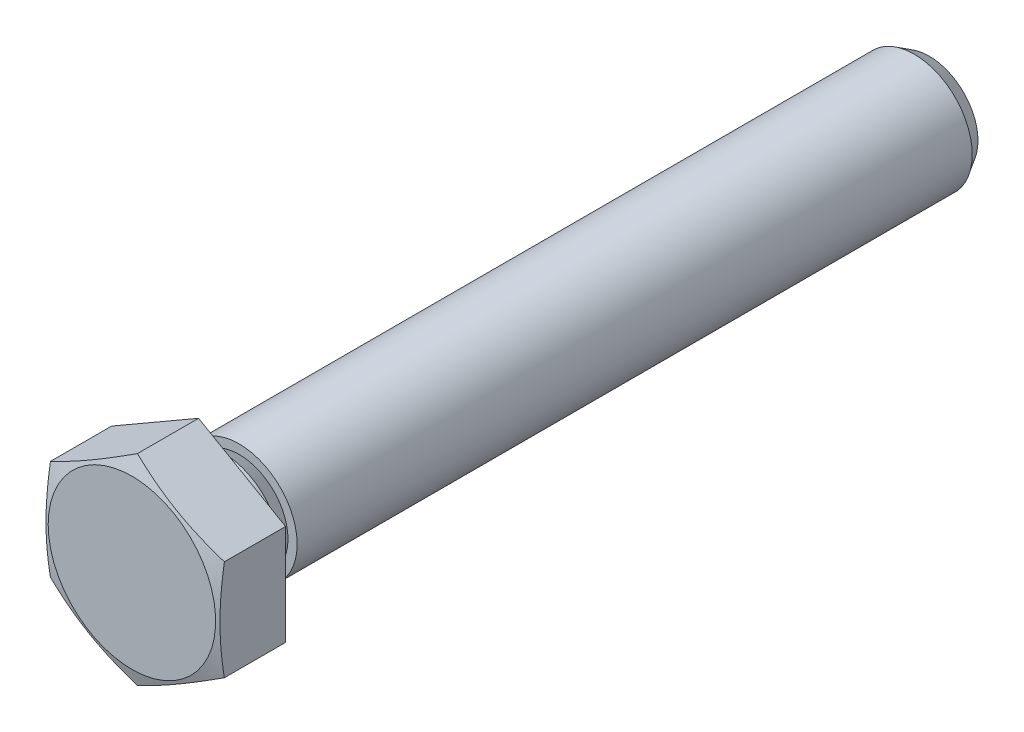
ISO-10303-21;
HEADER;
FILE_DESCRIPTION(('STEP AP214'),'2;1');
FILE_NAME('part.step','',(''),(''),'','','');
FILE_SCHEMA(('AUTOMOTIVE_DESIGN { 1 0 10303 214 1 1 1 1 }'));
ENDSEC;
DATA;
#1=APPLICATION_CONTEXT('core data for automotive mechanical design processes');
#2=APPLICATION_PROTOCOL_DEFINITION('international standard','automotive_design',2000,#1);
#3=PRODUCT_CONTEXT('',#1,'mechanical');
#4=PRODUCT('Part','Part','',(#3));
#5=PRODUCT_RELATED_PRODUCT_CATEGORY('part','',(#4));
#6=PRODUCT_DEFINITION_FORMATION('','',#4);
#7=PRODUCT_DEFINITION_CONTEXT('part definition',#1,'design');
#8=PRODUCT_DEFINITION('design','',#6,#7);
#9=PRODUCT_DEFINITION_SHAPE('','',#8);
#10=(LENGTH_UNIT() NAMED_UNIT(*) SI_UNIT(.MILLI.,.METRE.));
#11=(NAMED_UNIT(*) PLANE_ANGLE_UNIT() SI_UNIT($,.RADIAN.));
#12=(NAMED_UNIT(*) SI_UNIT($,.STERADIAN.) SOLID_ANGLE_UNIT());
#13=UNCERTAINTY_MEASURE_WITH_UNIT(LENGTH_MEASURE(1.E-05),#10,'distance_accuracy_value','');
#14=(GEOMETRIC_REPRESENTATION_CONTEXT(3) GLOBAL_UNCERTAINTY_ASSIGNED_CONTEXT((#13)) GLOBAL_UNIT_ASSIGNED_CONTEXT((#10,
#11,#12)) REPRESENTATION_CONTEXT('',''));
#15=CARTESIAN_POINT('',(0.,0.,0.));
#16=DIRECTION('',(0.,0.,1.));
#17=DIRECTION('',(1.,0.,0.));
#18=AXIS2_PLACEMENT_3D('',#15,#16,#17);
#19=CARTESIAN_POINT('',(0.,0.,0.600000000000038));
#20=DIRECTION('',(0.,0.,1.));
#21=DIRECTION('',(1.,0.,0.));
#22=AXIS2_PLACEMENT_3D('',#19,#20,#21);
#23=TOROIDAL_SURFACE('',#22,7.6,0.6);
#24=CARTESIAN_POINT('',(0.,0.,0.600000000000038));
#25=DIRECTION('',(0.,0.,1.));
#26=DIRECTION('',(1.,0.,0.));
#27=AXIS2_PLACEMENT_3D('',#24,#25,#26);
#28=CIRCLE('',#27,8.2);
#29=CARTESIAN_POINT('',(8.20000000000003,0.,0.600000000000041));
#30=VERTEX_POINT('',#29);
#31=EDGE_CURVE('E11',#30,#30,#28,.T.);
#32=ORIENTED_EDGE('',*,*,#31,.F.);
#33=EDGE_LOOP('',(#32));
#34=FACE_BOUND('',#33,.T.);
#35=CARTESIAN_POINT('',(0.,0.,0.));
#36=DIRECTION('',(0.,0.,1.));
#37=DIRECTION('',(1.,0.,0.));
#38=AXIS2_PLACEMENT_3D('',#35,#36,#37);
#39=CIRCLE('',#38,7.6);
#40=CARTESIAN_POINT('',(7.6,0.,0.));
#41=VERTEX_POINT('',#40);
#42=EDGE_CURVE('E24',#41,#41,#39,.T.);
#43=ORIENTED_EDGE('',*,*,#42,.T.);
#44=EDGE_LOOP('',(#43));
#45=FACE_BOUND('',#44,.T.);
#46=ADVANCED_FACE('F17',(#34,#45),#23,.T.);
#47=CARTESIAN_POINT('',(0.,7.6,0.));
#48=DIRECTION('',(0.,0.,-1.));
#49=DIRECTION('',(-1.,0.,0.));
#50=AXIS2_PLACEMENT_3D('',#47,#48,#49);
#51=PLANE('',#50);
#52=CARTESIAN_POINT('',(0.,0.,0.));
#53=DIRECTION('',(0.,0.,1.));
#54=DIRECTION('',(1.,0.,0.));
#55=AXIS2_PLACEMENT_3D('',#52,#53,#54);
#56=CIRCLE('',#55,6.6);
#57=CARTESIAN_POINT('',(6.6,0.,0.));
#58=VERTEX_POINT('',#57);
#59=EDGE_CURVE('E118',#58,#58,#56,.T.);
#60=ORIENTED_EDGE('',*,*,#59,.T.);
#61=EDGE_LOOP('',(#60));
#62=FACE_BOUND('',#61,.T.);
#63=ORIENTED_EDGE('',*,*,#42,.F.);
#64=EDGE_LOOP('',(#63));
#65=FACE_BOUND('',#64,.T.);
#66=ADVANCED_FACE('F124',(#62,#65),#51,.T.);
#67=CARTESIAN_POINT('',(0.,0.,-0.599999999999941));
#68=DIRECTION('',(0.,0.,1.));
#69=DIRECTION('',(1.,0.,0.));
#70=AXIS2_PLACEMENT_3D('',#67,#68,#69);
#71=TOROIDAL_SURFACE('',#70,6.6,0.6);
#72=CARTESIAN_POINT('',(0.,0.,-0.599999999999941));
#73=DIRECTION('',(0.,0.,1.));
#74=DIRECTION('',(1.,0.,0.));
#75=AXIS2_PLACEMENT_3D('',#72,#73,#74);
#76=CIRCLE('',#75,6.);
#77=CARTESIAN_POINT('',(5.99999999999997,0.,-0.599999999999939));
#78=VERTEX_POINT('',#77);
#79=EDGE_CURVE('E115',#78,#78,#76,.T.);
#80=ORIENTED_EDGE('',*,*,#79,.T.);
#81=EDGE_LOOP('',(#80));
#82=FACE_BOUND('',#81,.T.);
#83=ORIENTED_EDGE('',*,*,#59,.F.);
#84=EDGE_LOOP('',(#83));
#85=FACE_BOUND('',#84,.T.);
#86=ADVANCED_FACE('F126',(#82,#85),#71,.F.);
#87=CARTESIAN_POINT('',(0.,0.,0.600000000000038));
#88=DIRECTION('',(0.,0.,1.));
#89=DIRECTION('',(1.,0.,0.));
#90=AXIS2_PLACEMENT_3D('',#87,#88,#89);
#91=CYLINDRICAL_SURFACE('',#90,6.);
#92=CARTESIAN_POINT('',(0.,0.,-1.95942312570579));
#93=DIRECTION('',(0.,0.,1.));
#94=DIRECTION('',(1.,0.,0.));
#95=AXIS2_PLACEMENT_3D('',#92,#93,#94);
#96=CIRCLE('',#95,6.);
#97=CARTESIAN_POINT('',(5.99999999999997,0.,-1.95942312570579));
#98=VERTEX_POINT('',#97);
#99=EDGE_CURVE('E112',#98,#98,#96,.T.);
#100=ORIENTED_EDGE('',*,*,#99,.T.);
#101=EDGE_LOOP('',(#100));
#102=FACE_BOUND('',#101,.T.);
#103=ORIENTED_EDGE('',*,*,#79,.F.);
#104=EDGE_LOOP('',(#103));
#105=FACE_BOUND('',#104,.T.);
#106=ADVANCED_FACE('F133',(#102,#105),#91,.T.);
#107=CARTESIAN_POINT('',(0.,0.,-1.95942312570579));
#108=DIRECTION('',(0.,0.,1.));
#109=DIRECTION('',(1.,0.,0.));
#110=AXIS2_PLACEMENT_3D('',#107,#108,#109);
#111=CONICAL_SURFACE('',#110,6.,0.523598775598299);
#112=CARTESIAN_POINT('',(0.,0.,-3.6));
#113=DIRECTION('',(0.,0.,1.));
#114=DIRECTION('',(1.,0.,0.));
#115=AXIS2_PLACEMENT_3D('',#112,#113,#114);
#116=CIRCLE('',#115,5.0528125);
#117=CARTESIAN_POINT('',(5.0528125,0.,-3.6));
#118=VERTEX_POINT('',#117);
#119=EDGE_CURVE('E109',#118,#118,#116,.T.);
#120=ORIENTED_EDGE('',*,*,#119,.T.);
#121=EDGE_LOOP('',(#120));
#122=FACE_BOUND('',#121,.T.);
#123=ORIENTED_EDGE('',*,*,#99,.F.);
#124=EDGE_LOOP('',(#123));
#125=FACE_BOUND('',#124,.T.);
#126=ADVANCED_FACE('F140',(#122,#125),#111,.T.);
#127=CARTESIAN_POINT('',(0.,5.0528125,-3.59999999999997));
#128=DIRECTION('',(0.,0.,1.));
#129=DIRECTION('',(1.,0.,0.));
#130=AXIS2_PLACEMENT_3D('',#127,#128,#129);
#131=PLANE('',#130);
#132=CARTESIAN_POINT('',(0.,0.,-3.6));
#133=DIRECTION('',(0.,0.,1.));
#134=DIRECTION('',(1.,0.,0.));
#135=AXIS2_PLACEMENT_3D('',#132,#133,#134);
#136=CIRCLE('',#135,6.);
#137=CARTESIAN_POINT('',(6.,0.,-3.6));
#138=VERTEX_POINT('',#137);
#139=EDGE_CURVE('E106',#138,#138,#136,.T.);
#140=ORIENTED_EDGE('',*,*,#139,.T.);
#141=EDGE_LOOP('',(#140));
#142=FACE_BOUND('',#141,.T.);
#143=ORIENTED_EDGE('',*,*,#119,.F.);
#144=EDGE_LOOP('',(#143));
#145=FACE_BOUND('',#144,.T.);
#146=ADVANCED_FACE('F144',(#142,#145),#131,.T.);
#147=CARTESIAN_POINT('',(0.,0.,0.600000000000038));
#148=DIRECTION('',(0.,0.,1.));
#149=DIRECTION('',(1.,0.,0.));
#150=AXIS2_PLACEMENT_3D('',#147,#148,#149);
#151=CYLINDRICAL_SURFACE('',#150,6.);
#152=CARTESIAN_POINT('',(0.,0.,-73.4528125));
#153=DIRECTION('',(0.,0.,1.));
#154=DIRECTION('',(1.,0.,0.));
#155=AXIS2_PLACEMENT_3D('',#152,#153,#154);
#156=CIRCLE('',#155,6.);
#157=CARTESIAN_POINT('',(5.99999999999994,0.,-73.4528125));
#158=VERTEX_POINT('',#157);
#159=EDGE_CURVE('E103',#158,#158,#156,.T.);
#160=ORIENTED_EDGE('',*,*,#159,.T.);
#161=EDGE_LOOP('',(#160));
#162=FACE_BOUND('',#161,.T.);
#163=ORIENTED_EDGE('',*,*,#139,.F.);
#164=EDGE_LOOP('',(#163));
#165=FACE_BOUND('',#164,.T.);
#166=ADVANCED_FACE('F148',(#162,#165),#151,.T.);
#167=CARTESIAN_POINT('',(0.,0.,-73.4528125));
#168=DIRECTION('',(0.,0.,1.));
#169=DIRECTION('',(1.,0.,0.));
#170=AXIS2_PLACEMENT_3D('',#167,#168,#169);
#171=CONICAL_SURFACE('',#170,6.,0.549341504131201);
#172=CARTESIAN_POINT('',(0.,0.,-75.0000000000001));
#173=DIRECTION('',(0.,0.,1.));
#174=DIRECTION('',(1.,0.,0.));
#175=AXIS2_PLACEMENT_3D('',#172,#173,#174);
#176=CIRCLE('',#175,5.0528125);
#177=CARTESIAN_POINT('',(5.05281249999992,0.,-75.0000000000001));
#178=VERTEX_POINT('',#177);
#179=EDGE_CURVE('E100',#178,#178,#176,.T.);
#180=ORIENTED_EDGE('',*,*,#179,.T.);
#181=EDGE_LOOP('',(#180));
#182=FACE_BOUND('',#181,.T.);
#183=ORIENTED_EDGE('',*,*,#159,.F.);
#184=EDGE_LOOP('',(#183));
#185=FACE_BOUND('',#184,.T.);
#186=ADVANCED_FACE('F152',(#182,#185),#171,.T.);
#187=CARTESIAN_POINT('',(-1.11022302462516E-13,5.0528125,-75.));
#188=DIRECTION('',(0.,0.,-1.));
#189=DIRECTION('',(-1.,0.,0.));
#190=AXIS2_PLACEMENT_3D('',#187,#188,#189);
#191=PLANE('',#190);
#192=ORIENTED_EDGE('',*,*,#179,.F.);
#193=EDGE_LOOP('',(#192));
#194=FACE_BOUND('',#193,.T.);
#195=ADVANCED_FACE('F156',(#194),#191,.T.);
#196=CARTESIAN_POINT('',(-9.00000000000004,-5.19615000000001,0.60000000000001));
#197=DIRECTION('',(0.,0.,-1.));
#198=DIRECTION('',(-1.,0.,0.));
#199=AXIS2_PLACEMENT_3D('',#196,#197,#198);
#200=PLANE('',#199);
#201=DIRECTION('',(0.,-1.,0.));
#202=VECTOR('',#201,1.);
#203=CARTESIAN_POINT('',(-9.00000000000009,5.19614999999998,0.600000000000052));
#204=LINE('',#203,#202);
#205=CARTESIAN_POINT('',(-9.00000000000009,5.19614999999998,0.600000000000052));
#206=VERTEX_POINT('',#205);
#207=CARTESIAN_POINT('',(-9.00000000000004,-5.19615000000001,0.60000000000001));
#208=VERTEX_POINT('',#207);
#209=EDGE_CURVE('E83',#206,#208,#204,.T.);
#210=ORIENTED_EDGE('',*,*,#209,.F.);
#211=DIRECTION('',(0.866025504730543,0.499999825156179,0.));
#212=VECTOR('',#211,1.);
#213=CARTESIAN_POINT('',(-9.00000000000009,5.19614999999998,0.600000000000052));
#214=LINE('',#213,#212);
#215=CARTESIAN_POINT('',(0.,10.3923,0.600000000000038));
#216=VERTEX_POINT('',#215);
#217=EDGE_CURVE('E88',#206,#216,#214,.T.);
#218=ORIENTED_EDGE('',*,*,#217,.T.);
#219=DIRECTION('',(0.866025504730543,-0.49999982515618,0.));
#220=VECTOR('',#219,1.);
#221=CARTESIAN_POINT('',(0.,10.3923,0.600000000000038));
#222=LINE('',#221,#220);
#223=CARTESIAN_POINT('',(8.99999999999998,5.19614999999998,0.600000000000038));
#224=VERTEX_POINT('',#223);
#225=EDGE_CURVE('E94',#216,#224,#222,.T.);
#226=ORIENTED_EDGE('',*,*,#225,.T.);
#227=DIRECTION('',(0.,-1.,0.));
#228=VECTOR('',#227,1.);
#229=CARTESIAN_POINT('',(8.99999999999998,5.19614999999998,0.600000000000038));
#230=LINE('',#229,#228);
#231=CARTESIAN_POINT('',(8.99999999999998,-5.19615000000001,0.600000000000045));
#232=VERTEX_POINT('',#231);
#233=EDGE_CURVE('E246',#224,#232,#230,.T.);
#234=ORIENTED_EDGE('',*,*,#233,.T.);
#235=DIRECTION('',(-0.866025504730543,-0.499999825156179,0.));
#236=VECTOR('',#235,1.);
#237=CARTESIAN_POINT('',(8.99999999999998,-5.19615000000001,0.600000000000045));
#238=LINE('',#237,#236);
#239=CARTESIAN_POINT('',(0.,-10.3923,0.600000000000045));
#240=VERTEX_POINT('',#239);
#241=EDGE_CURVE('E232',#232,#240,#238,.T.);
#242=ORIENTED_EDGE('',*,*,#241,.T.);
#243=DIRECTION('',(-0.866025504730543,0.49999982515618,0.));
#244=VECTOR('',#243,1.);
#245=CARTESIAN_POINT('',(0.,-10.3923,0.600000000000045));
#246=LINE('',#245,#244);
#247=EDGE_CURVE('E230',#240,#208,#246,.T.);
#248=ORIENTED_EDGE('',*,*,#247,.T.);
#249=EDGE_LOOP('',(#210,#218,#226,#234,#242,#248));
#250=FACE_BOUND('',#249,.T.);
#251=ORIENTED_EDGE('',*,*,#31,.T.);
#252=EDGE_LOOP('',(#251));
#253=FACE_BOUND('',#252,.T.);
#254=ADVANCED_FACE('F160',(#250,#253),#200,.T.);
#255=CARTESIAN_POINT('',(-9.00000000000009,5.19614999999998,0.600000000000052));
#256=DIRECTION('',(-1.,0.,0.));
#257=DIRECTION('',(0.,0.,1.));
#258=AXIS2_PLACEMENT_3D('',#255,#256,#257);
#259=PLANE('',#258);
#260=CARTESIAN_POINT('',(-9.00000000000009,5.95423780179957,6.79715844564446));
#261=CARTESIAN_POINT('',(-9.00000000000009,5.54564744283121,6.87159629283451));
#262=CARTESIAN_POINT('',(-9.00000000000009,5.13604876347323,6.94092883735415));
#263=CARTESIAN_POINT('',(-9.00000000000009,4.31470783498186,7.06703659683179));
#264=CARTESIAN_POINT('',(-9.00000000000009,3.90296454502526,7.12380499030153));
#265=CARTESIAN_POINT('',(-9.00000000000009,3.07806157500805,7.22230281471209));
#266=CARTESIAN_POINT('',(-9.00000000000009,2.66490371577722,7.2640471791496));
#267=CARTESIAN_POINT('',(-9.00000000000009,1.83726932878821,7.33036502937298));
#268=CARTESIAN_POINT('',(-9.0000000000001,1.42279307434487,7.35494186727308));
#269=CARTESIAN_POINT('',(-9.0000000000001,0.599064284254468,7.38521789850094));
#270=CARTESIAN_POINT('',(-9.0000000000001,0.189821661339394,7.39118162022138));
#271=CARTESIAN_POINT('',(-9.00000000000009,-0.628531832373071,7.38459727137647));
#272=CARTESIAN_POINT('',(-9.00000000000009,-1.03764269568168,7.37204828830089));
#273=CARTESIAN_POINT('',(-9.0000000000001,-1.85481063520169,7.32923293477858));
#274=CARTESIAN_POINT('',(-9.00000000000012,-2.26286795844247,7.29897118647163));
#275=CARTESIAN_POINT('',(-9.00000000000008,-3.07746196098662,7.22245596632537));
#276=CARTESIAN_POINT('',(-9.00000000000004,-3.48399861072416,7.17620218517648));
#277=CARTESIAN_POINT('',(-9.00000000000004,-4.30358760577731,7.06882304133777));
#278=CARTESIAN_POINT('',(-9.00000000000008,-4.71660190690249,7.00741126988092));
#279=CARTESIAN_POINT('',(-9.00000000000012,-5.54066219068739,6.87266771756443));
#280=CARTESIAN_POINT('',(-9.00000000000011,-5.95170815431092,6.79933582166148));
#281=CARTESIAN_POINT('',(-9.0000000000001,-6.7722480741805,6.64291279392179));
#282=CARTESIAN_POINT('',(-9.0000000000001,-7.18174060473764,6.55981424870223));
#283=CARTESIAN_POINT('',(-9.0000000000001,-7.99904439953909,6.38579151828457));
#284=CARTESIAN_POINT('',(-9.0000000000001,-8.40685567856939,6.29486740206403));
#285=CARTESIAN_POINT('',(-9.0000000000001,-9.22794484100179,6.10513014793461));
#286=CARTESIAN_POINT('',(-9.0000000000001,-9.64119766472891,6.00620909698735));
#287=CARTESIAN_POINT('',(-9.0000000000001,-10.4664191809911,5.80314354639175));
#288=CARTESIAN_POINT('',(-9.0000000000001,-10.8783878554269,5.69899897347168));
#289=CARTESIAN_POINT('',(-9.00000000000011,-11.7003471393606,5.48673379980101));
#290=CARTESIAN_POINT('',(-9.00000000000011,-12.1103400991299,5.37862226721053));
#291=CARTESIAN_POINT('',(-9.0000000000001,-12.9293777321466,5.15896707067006));
#292=CARTESIAN_POINT('',(-9.00000000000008,-13.3384224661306,5.04742363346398));
#293=CARTESIAN_POINT('',(-9.00000000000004,-13.7470885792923,4.93453459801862));
#294=B_SPLINE_CURVE_WITH_KNOTS('',3,(#260,#261,#262,#263,#264,#265,#266,#267,#268,#269,#270,
#271,#272,#273,#274,#275,#276,#277,#278,#279,#280,#281,#282,#283,#284,#285,#286,#287,#288,#289,
#290,#291,#292,#293),.UNSPECIFIED.,.F.,.F.,(4,2,2,2,2,2,2,2,2,2,2,2,2,2,2,2,4),(0.,
1.24603035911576,2.49273557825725,3.73819815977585,4.98341748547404,6.2108573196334,
7.43835765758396,8.66553782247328,9.89274172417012,11.1451959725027,12.3976623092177,
13.6510855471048,14.9044977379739,16.1792379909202,17.4539961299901,18.726002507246,
19.9979250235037),.UNSPECIFIED.);
#295=CARTESIAN_POINT('',(-9.00000000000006,5.19614999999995,6.92894463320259));
#296=VERTEX_POINT('',#295);
#297=CARTESIAN_POINT('',(-9.00000000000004,-5.19615000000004,6.92894463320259));
#298=VERTEX_POINT('',#297);
#299=EDGE_CURVE('E72',#296,#298,#294,.T.);
#300=ORIENTED_EDGE('',*,*,#299,.F.);
#301=DIRECTION('',(0.,0.,1.));
#302=VECTOR('',#301,1.);
#303=CARTESIAN_POINT('',(-9.00000000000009,5.19614999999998,0.600000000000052));
#304=LINE('',#303,#302);
#305=EDGE_CURVE('E81',#206,#296,#304,.T.);
#306=ORIENTED_EDGE('',*,*,#305,.F.);
#307=ORIENTED_EDGE('',*,*,#209,.T.);
#308=DIRECTION('',(0.,0.,1.));
#309=VECTOR('',#308,1.);
#310=CARTESIAN_POINT('',(-9.00000000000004,-5.19615000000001,0.60000000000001));
#311=LINE('',#310,#309);
#312=EDGE_CURVE('E39',#208,#298,#311,.T.);
#313=ORIENTED_EDGE('',*,*,#312,.T.);
#314=EDGE_LOOP('',(#300,#306,#307,#313));
#315=FACE_BOUND('',#314,.T.);
#316=ADVANCED_FACE('F79',(#315),#259,.T.);
#317=CARTESIAN_POINT('',(0.,-10.3923,0.600000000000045));
#318=DIRECTION('',(0.499999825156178,0.866025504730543,0.));
#319=DIRECTION('',(0.866025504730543,-0.49999982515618,0.));
#320=AXIS2_PLACEMENT_3D('',#317,#318,#319);
#321=PLANE('',#320);
#322=DIRECTION('',(0.,0.,1.));
#323=VECTOR('',#322,1.);
#324=CARTESIAN_POINT('',(0.,-10.3923,0.600000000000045));
#325=LINE('',#324,#323);
#326=CARTESIAN_POINT('',(0.,-10.3923,6.92894583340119));
#327=VERTEX_POINT('',#326);
#328=EDGE_CURVE('E237',#240,#327,#325,.T.);
#329=ORIENTED_EDGE('',*,*,#328,.T.);
#330=CARTESIAN_POINT('',(1.99999988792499E-07,-10.39230011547,6.92894579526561));
#331=CARTESIAN_POINT('',(-0.373107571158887,-10.1768863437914,7.00011400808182));
#332=CARTESIAN_POINT('',(-0.747233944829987,-9.96088448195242,7.06480339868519));
#333=CARTESIAN_POINT('',(-1.49749109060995,-9.52772351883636,7.17855326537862));
#334=CARTESIAN_POINT('',(-1.87362298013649,-9.31056377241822,7.2276038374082));
#335=CARTESIAN_POINT('',(-2.62444400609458,-8.87707725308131,7.3069968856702));
#336=CARTESIAN_POINT('',(-2.99912148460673,-8.66075721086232,7.33748241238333));
#337=CARTESIAN_POINT('',(-3.7491994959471,-8.22769967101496,7.37836755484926));
#338=CARTESIAN_POINT('',(-4.12459977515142,-8.01096231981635,7.38877325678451));
#339=CARTESIAN_POINT('',(-4.87540032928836,-7.57748761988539,7.38877313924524));
#340=CARTESIAN_POINT('',(-5.25080060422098,-7.36075027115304,7.37836731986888));
#341=CARTESIAN_POINT('',(-6.00087860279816,-6.9276927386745,7.33748195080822));
#342=CARTESIAN_POINT('',(-6.37555607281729,-6.71137270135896,7.30699631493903));
#343=CARTESIAN_POINT('',(-7.1263770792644,-6.27788619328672,7.22760306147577));
#344=CARTESIAN_POINT('',(-7.50250895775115,-6.06072645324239,7.17855239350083));
#345=CARTESIAN_POINT('',(-8.25276607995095,-5.62756550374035,7.0648023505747));
#346=CARTESIAN_POINT('',(-8.62689244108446,-5.41156364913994,7.00011287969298));
#347=CARTESIAN_POINT('',(-9.00000020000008,-5.19614988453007,6.92894459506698));
#348=B_SPLINE_CURVE_WITH_KNOTS('',3,(#330,#331,#332,#333,#334,#335,#336,#337,#338,#339,#340,
#341,#342,#343,#344,#345,#346,#347),.UNSPECIFIED.,.F.,.F.,(4,2,2,2,2,2,2,2,4),(0.,
1.31010734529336,2.62104274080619,3.92174468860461,5.22205233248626,6.52235997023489,
7.82306191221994,9.13399730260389,10.4441046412),.UNSPECIFIED.);
#349=EDGE_CURVE('E84',#327,#298,#348,.T.);
#350=ORIENTED_EDGE('',*,*,#349,.T.);
#351=ORIENTED_EDGE('',*,*,#312,.F.);
#352=ORIENTED_EDGE('',*,*,#247,.F.);
#353=EDGE_LOOP('',(#329,#350,#351,#352));
#354=FACE_BOUND('',#353,.T.);
#355=ADVANCED_FACE('F165',(#354),#321,.F.);
#356=CARTESIAN_POINT('',(8.99999999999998,-5.19615000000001,0.600000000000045));
#357=DIRECTION('',(-0.49999982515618,0.866025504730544,0.));
#358=DIRECTION('',(0.866025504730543,0.499999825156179,0.));
#359=AXIS2_PLACEMENT_3D('',#356,#357,#358);
#360=PLANE('',#359);
#361=DIRECTION('',(0.,0.,1.));
#362=VECTOR('',#361,1.);
#363=CARTESIAN_POINT('',(8.99999999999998,-5.19615000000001,0.600000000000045));
#364=LINE('',#363,#362);
#365=CARTESIAN_POINT('',(8.99999999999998,-5.19615000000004,6.92894463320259));
#366=VERTEX_POINT('',#365);
#367=EDGE_CURVE('E240',#232,#366,#364,.T.);
#368=ORIENTED_EDGE('',*,*,#367,.T.);
#369=CARTESIAN_POINT('',(9.00000020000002,-5.19614988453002,6.92894459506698));
#370=CARTESIAN_POINT('',(8.62689244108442,-5.41156364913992,7.00011287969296));
#371=CARTESIAN_POINT('',(8.25276607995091,-5.62756550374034,7.06480235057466));
#372=CARTESIAN_POINT('',(7.50250895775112,-6.06072645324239,7.17855239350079));
#373=CARTESIAN_POINT('',(7.12637707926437,-6.27788619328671,7.22760306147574));
#374=CARTESIAN_POINT('',(6.37555607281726,-6.71137270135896,7.306996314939));
#375=CARTESIAN_POINT('',(6.00087860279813,-6.9276927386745,7.33748195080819));
#376=CARTESIAN_POINT('',(5.25080060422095,-7.36075027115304,7.37836731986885));
#377=CARTESIAN_POINT('',(4.87540032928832,-7.57748761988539,7.38877313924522));
#378=CARTESIAN_POINT('',(4.12459977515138,-8.01096231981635,7.38877325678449));
#379=CARTESIAN_POINT('',(3.74919949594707,-8.22769967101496,7.37836755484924));
#380=CARTESIAN_POINT('',(2.99912148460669,-8.66075721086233,7.33748241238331));
#381=CARTESIAN_POINT('',(2.62444400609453,-8.87707725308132,7.30699688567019));
#382=CARTESIAN_POINT('',(1.87362298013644,-9.31056377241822,7.22760383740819));
#383=CARTESIAN_POINT('',(1.4974910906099,-9.52772351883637,7.17855326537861));
#384=CARTESIAN_POINT('',(0.747233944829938,-9.96088448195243,7.06480339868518));
#385=CARTESIAN_POINT('',(0.373107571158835,-10.1768863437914,7.00011400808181));
#386=CARTESIAN_POINT('',(-2.0000004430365E-07,-10.39230011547,6.9289457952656));
#387=B_SPLINE_CURVE_WITH_KNOTS('',3,(#369,#370,#371,#372,#373,#374,#375,#376,#377,#378,#379,
#380,#381,#382,#383,#384,#385,#386),.UNSPECIFIED.,.F.,.F.,(4,2,2,2,2,2,2,2,4),(0.,
1.31010733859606,2.62104272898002,3.92174467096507,5.2220523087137,6.52235995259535,
7.82306190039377,9.13399729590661,10.4441046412),.UNSPECIFIED.);
#388=EDGE_CURVE('E203',#366,#327,#387,.T.);
#389=ORIENTED_EDGE('',*,*,#388,.T.);
#390=ORIENTED_EDGE('',*,*,#328,.F.);
#391=ORIENTED_EDGE('',*,*,#241,.F.);
#392=EDGE_LOOP('',(#368,#389,#390,#391));
#393=FACE_BOUND('',#392,.T.);
#394=ADVANCED_FACE('F208',(#393),#360,.F.);
#395=CARTESIAN_POINT('',(8.99999999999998,5.19614999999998,0.600000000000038));
#396=DIRECTION('',(-1.,0.,0.));
#397=DIRECTION('',(0.,0.,1.));
#398=AXIS2_PLACEMENT_3D('',#395,#396,#397);
#399=PLANE('',#398);
#400=DIRECTION('',(0.,0.,1.));
#401=VECTOR('',#400,1.);
#402=CARTESIAN_POINT('',(8.99999999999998,5.19614999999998,0.600000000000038));
#403=LINE('',#402,#401);
#404=CARTESIAN_POINT('',(8.9999999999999,5.19615000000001,6.92894463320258));
#405=VERTEX_POINT('',#404);
#406=EDGE_CURVE('E92',#224,#405,#403,.T.);
#407=ORIENTED_EDGE('',*,*,#406,.T.);
#408=CARTESIAN_POINT('',(8.99999999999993,5.95423780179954,6.79715844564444));
#409=CARTESIAN_POINT('',(8.99999999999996,5.54564744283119,6.87159629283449));
#410=CARTESIAN_POINT('',(8.99999999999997,5.13604876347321,6.94092883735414));
#411=CARTESIAN_POINT('',(8.99999999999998,4.31470783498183,7.06703659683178));
#412=CARTESIAN_POINT('',(8.99999999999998,3.90296454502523,7.12380499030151));
#413=CARTESIAN_POINT('',(8.99999999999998,3.07806157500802,7.22230281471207));
#414=CARTESIAN_POINT('',(8.99999999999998,2.66490371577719,7.26404717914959));
#415=CARTESIAN_POINT('',(8.99999999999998,1.83726932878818,7.33036502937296));
#416=CARTESIAN_POINT('',(8.99999999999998,1.42279307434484,7.35494186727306));
#417=CARTESIAN_POINT('',(8.99999999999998,0.599064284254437,7.38521789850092));
#418=CARTESIAN_POINT('',(8.99999999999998,0.189821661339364,7.39118162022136));
#419=CARTESIAN_POINT('',(8.99999999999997,-0.6285318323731,7.38459727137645));
#420=CARTESIAN_POINT('',(8.99999999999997,-1.03764269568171,7.37204828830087));
#421=CARTESIAN_POINT('',(8.99999999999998,-1.85481063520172,7.32923293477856));
#422=CARTESIAN_POINT('',(8.99999999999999,-2.2628679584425,7.2989711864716));
#423=CARTESIAN_POINT('',(8.99999999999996,-3.07746196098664,7.22245596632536));
#424=CARTESIAN_POINT('',(8.99999999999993,-3.48399861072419,7.17620218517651));
#425=CARTESIAN_POINT('',(8.99999999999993,-4.30358760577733,7.0688230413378));
#426=CARTESIAN_POINT('',(8.99999999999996,-4.7166019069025,7.00741126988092));
#427=CARTESIAN_POINT('',(8.99999999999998,-5.5406621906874,6.8726677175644));
#428=CARTESIAN_POINT('',(8.99999999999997,-5.95170815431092,6.79933582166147));
#429=CARTESIAN_POINT('',(8.99999999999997,-6.7722480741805,6.64291279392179));
#430=CARTESIAN_POINT('',(8.99999999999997,-7.18174060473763,6.55981424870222));
#431=CARTESIAN_POINT('',(8.99999999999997,-7.99904439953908,6.38579151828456));
#432=CARTESIAN_POINT('',(8.99999999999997,-8.40685567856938,6.29486740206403));
#433=CARTESIAN_POINT('',(8.99999999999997,-9.22794484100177,6.10513014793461));
#434=CARTESIAN_POINT('',(8.99999999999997,-9.64119766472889,6.00620909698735));
#435=CARTESIAN_POINT('',(8.99999999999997,-10.4664191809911,5.80314354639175));
#436=CARTESIAN_POINT('',(8.99999999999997,-10.8783878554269,5.69899897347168));
#437=CARTESIAN_POINT('',(8.99999999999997,-11.7003471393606,5.48673379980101));
#438=CARTESIAN_POINT('',(8.99999999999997,-12.1103400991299,5.37862226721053));
#439=CARTESIAN_POINT('',(8.99999999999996,-12.9293777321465,5.15896707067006));
#440=CARTESIAN_POINT('',(8.99999999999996,-13.3384224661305,5.04742363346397));
#441=CARTESIAN_POINT('',(8.99999999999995,-13.7470885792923,4.9345345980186));
#442=B_SPLINE_CURVE_WITH_KNOTS('',3,(#408,#409,#410,#411,#412,#413,#414,#415,#416,#417,#418,
#419,#420,#421,#422,#423,#424,#425,#426,#427,#428,#429,#430,#431,#432,#433,#434,#435,#436,#437,
#438,#439,#440,#441),.UNSPECIFIED.,.F.,.F.,(4,2,2,2,2,2,2,2,2,2,2,2,2,2,2,2,4),(0.,
1.24603035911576,2.49273557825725,3.73819815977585,4.98341748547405,6.2108573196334,
7.43835765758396,8.66553782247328,9.89274172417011,11.1451959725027,12.3976623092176,
13.6510855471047,14.9044977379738,16.1792379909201,17.45399612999,18.7260025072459,
19.9979250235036),.UNSPECIFIED.);
#443=EDGE_CURVE('E198',#405,#366,#442,.T.);
#444=ORIENTED_EDGE('',*,*,#443,.T.);
#445=ORIENTED_EDGE('',*,*,#367,.F.);
#446=ORIENTED_EDGE('',*,*,#233,.F.);
#447=EDGE_LOOP('',(#407,#444,#445,#446));
#448=FACE_BOUND('',#447,.T.);
#449=ADVANCED_FACE('F211',(#448),#399,.F.);
#450=CARTESIAN_POINT('',(0.,10.3923,0.600000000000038));
#451=DIRECTION('',(-0.499999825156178,-0.866025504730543,0.));
#452=DIRECTION('',(-0.866025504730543,0.49999982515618,0.));
#453=AXIS2_PLACEMENT_3D('',#450,#451,#452);
#454=PLANE('',#453);
#455=DIRECTION('',(0.,0.,1.));
#456=VECTOR('',#455,1.);
#457=CARTESIAN_POINT('',(0.,10.3923,0.600000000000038));
#458=LINE('',#457,#456);
#459=CARTESIAN_POINT('',(0.,10.3923,6.92894583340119));
#460=VERTEX_POINT('',#459);
#461=EDGE_CURVE('E90',#216,#460,#458,.T.);
#462=ORIENTED_EDGE('',*,*,#461,.T.);
#463=CARTESIAN_POINT('',(-2.00000072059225E-07,10.39230011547,6.92894579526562));
#464=CARTESIAN_POINT('',(0.373107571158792,10.1768863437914,7.00011400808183));
#465=CARTESIAN_POINT('',(0.747233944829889,9.9608844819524,7.06480339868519));
#466=CARTESIAN_POINT('',(1.49749109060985,9.52772351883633,7.17855326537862));
#467=CARTESIAN_POINT('',(1.87362298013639,9.31056377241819,7.2276038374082));
#468=CARTESIAN_POINT('',(2.62444400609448,8.87707725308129,7.3069968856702));
#469=CARTESIAN_POINT('',(2.99912148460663,8.6607572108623,7.33748241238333));
#470=CARTESIAN_POINT('',(3.749199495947,8.22769967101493,7.37836755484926));
#471=CARTESIAN_POINT('',(4.12459977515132,8.01096231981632,7.38877325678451));
#472=CARTESIAN_POINT('',(4.87540032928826,7.57748761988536,7.38877313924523));
#473=CARTESIAN_POINT('',(5.25080060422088,7.36075027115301,7.37836731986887));
#474=CARTESIAN_POINT('',(6.00087860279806,6.92769273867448,7.33748195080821));
#475=CARTESIAN_POINT('',(6.37555607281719,6.71137270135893,7.30699631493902));
#476=CARTESIAN_POINT('',(7.1263770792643,6.27788619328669,7.22760306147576));
#477=CARTESIAN_POINT('',(7.50250895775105,6.06072645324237,7.17855239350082));
#478=CARTESIAN_POINT('',(8.25276607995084,5.62756550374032,7.06480235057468));
#479=CARTESIAN_POINT('',(8.62689244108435,5.4115636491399,7.00011287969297));
#480=CARTESIAN_POINT('',(9.00000019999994,5.19614988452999,6.92894459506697));
#481=B_SPLINE_CURVE_WITH_KNOTS('',3,(#463,#464,#465,#466,#467,#468,#469,#470,#471,#472,#473,
#474,#475,#476,#477,#478,#479,#480),.UNSPECIFIED.,.F.,.F.,(4,2,2,2,2,2,2,2,4),(0.,
1.31010734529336,2.62104274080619,3.92174468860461,5.22205233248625,6.52235997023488,
7.82306191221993,9.13399730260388,10.4441046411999),.UNSPECIFIED.);
#482=EDGE_CURVE('E31',#460,#405,#481,.T.);
#483=ORIENTED_EDGE('',*,*,#482,.T.);
#484=ORIENTED_EDGE('',*,*,#406,.F.);
#485=ORIENTED_EDGE('',*,*,#225,.F.);
#486=EDGE_LOOP('',(#462,#483,#484,#485));
#487=FACE_BOUND('',#486,.T.);
#488=ADVANCED_FACE('F215',(#487),#454,.F.);
#489=CARTESIAN_POINT('',(-9.00000000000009,5.19614999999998,0.600000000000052));
#490=DIRECTION('',(0.49999982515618,-0.866025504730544,0.));
#491=DIRECTION('',(-0.866025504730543,-0.499999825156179,0.));
#492=AXIS2_PLACEMENT_3D('',#489,#490,#491);
#493=PLANE('',#492);
#494=ORIENTED_EDGE('',*,*,#305,.T.);
#495=CARTESIAN_POINT('',(-9.00000020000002,5.19614988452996,6.92894459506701));
#496=CARTESIAN_POINT('',(-8.62689244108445,5.41156364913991,7.00011287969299));
#497=CARTESIAN_POINT('',(-8.25276607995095,5.62756550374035,7.0648023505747));
#498=CARTESIAN_POINT('',(-7.50250895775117,6.0607264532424,7.17855239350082));
#499=CARTESIAN_POINT('',(-7.12637707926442,6.27788619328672,7.22760306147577));
#500=CARTESIAN_POINT('',(-6.37555607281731,6.71137270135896,7.30699631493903));
#501=CARTESIAN_POINT('',(-6.00087860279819,6.9276927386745,7.33748195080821));
#502=CARTESIAN_POINT('',(-5.25080060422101,7.36075027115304,7.37836731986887));
#503=CARTESIAN_POINT('',(-4.87540032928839,7.57748761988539,7.38877313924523));
#504=CARTESIAN_POINT('',(-4.12459977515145,8.01096231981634,7.38877325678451));
#505=CARTESIAN_POINT('',(-3.74919949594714,8.22769967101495,7.37836755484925));
#506=CARTESIAN_POINT('',(-2.99912148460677,8.66075721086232,7.33748241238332));
#507=CARTESIAN_POINT('',(-2.62444400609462,8.87707725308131,7.3069968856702));
#508=CARTESIAN_POINT('',(-1.87362298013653,9.31056377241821,7.2276038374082));
#509=CARTESIAN_POINT('',(-1.49749109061,9.52772351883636,7.17855326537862));
#510=CARTESIAN_POINT('',(-0.747233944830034,9.96088448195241,7.06480339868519));
#511=CARTESIAN_POINT('',(-0.373107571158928,10.1768863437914,7.00011400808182));
#512=CARTESIAN_POINT('',(1.99999961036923E-07,10.39230011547,6.9289457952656));
#513=B_SPLINE_CURVE_WITH_KNOTS('',3,(#495,#496,#497,#498,#499,#500,#501,#502,#503,#504,#505,
#506,#507,#508,#509,#510,#511,#512),.UNSPECIFIED.,.F.,.F.,(4,2,2,2,2,2,2,2,4),(0.,
1.31010733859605,2.62104272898,3.92174467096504,5.22205230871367,6.52235995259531,
7.82306190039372,9.13399729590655,10.4441046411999),.UNSPECIFIED.);
#514=EDGE_CURVE('E68',#296,#460,#513,.T.);
#515=ORIENTED_EDGE('',*,*,#514,.T.);
#516=ORIENTED_EDGE('',*,*,#461,.F.);
#517=ORIENTED_EDGE('',*,*,#217,.F.);
#518=EDGE_LOOP('',(#494,#515,#516,#517));
#519=FACE_BOUND('',#518,.T.);
#520=ADVANCED_FACE('F86',(#519),#493,.F.);
#521=CARTESIAN_POINT('',(0.,0.,6.86030181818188));
#522=DIRECTION('',(0.,0.,-1.));
#523=DIRECTION('',(-1.,0.,0.));
#524=AXIS2_PLACEMENT_3D('',#521,#522,#523);
#525=CONICAL_SURFACE('',#524,10.600146,1.25181086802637);
#526=ORIENTED_EDGE('',*,*,#299,.T.);
#527=ORIENTED_EDGE('',*,*,#349,.F.);
#528=ORIENTED_EDGE('',*,*,#388,.F.);
#529=ORIENTED_EDGE('',*,*,#443,.F.);
#530=ORIENTED_EDGE('',*,*,#482,.F.);
#531=ORIENTED_EDGE('',*,*,#514,.F.);
#532=EDGE_LOOP('',(#526,#527,#528,#529,#530,#531));
#533=FACE_BOUND('',#532,.T.);
#534=CARTESIAN_POINT('',(0.,0.,7.50000000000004));
#535=DIRECTION('',(0.,0.,-1.));
#536=DIRECTION('',(-1.,0.,0.));
#537=AXIS2_PLACEMENT_3D('',#534,#535,#536);
#538=CIRCLE('',#537,8.66321518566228);
#539=CARTESIAN_POINT('',(-8.66321518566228,0.,7.50000000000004));
#540=VERTEX_POINT('',#539);
#541=EDGE_CURVE('E76',#540,#540,#538,.F.);
#542=ORIENTED_EDGE('',*,*,#541,.F.);
#543=EDGE_LOOP('',(#542));
#544=FACE_BOUND('',#543,.T.);
#545=ADVANCED_FACE('F70',(#533,#544),#525,.T.);
#546=CARTESIAN_POINT('',(-8.99999999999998,-5.19615000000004,7.50000000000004));
#547=DIRECTION('',(0.,0.,-1.));
#548=DIRECTION('',(-1.,0.,0.));
#549=AXIS2_PLACEMENT_3D('',#546,#547,#548);
#550=PLANE('',#549);
#551=ORIENTED_EDGE('',*,*,#541,.T.);
#552=EDGE_LOOP('',(#551));
#553=FACE_BOUND('',#552,.T.);
#554=ADVANCED_FACE('F181',(#553),#550,.F.);
#555=CLOSED_SHELL('',(#46,#66,#86,#106,#126,#146,#166,#186,#195,#254,#316,#355,#394,#449,#488,
#520,#545,#554));
#556=MANIFOLD_SOLID_BREP('B1',#555);
#557=ADVANCED_BREP_SHAPE_REPRESENTATION('',(#18,#556),#14);
#558=SHAPE_DEFINITION_REPRESENTATION(#9,#557);
ENDSEC;
END-ISO-10303-21;
